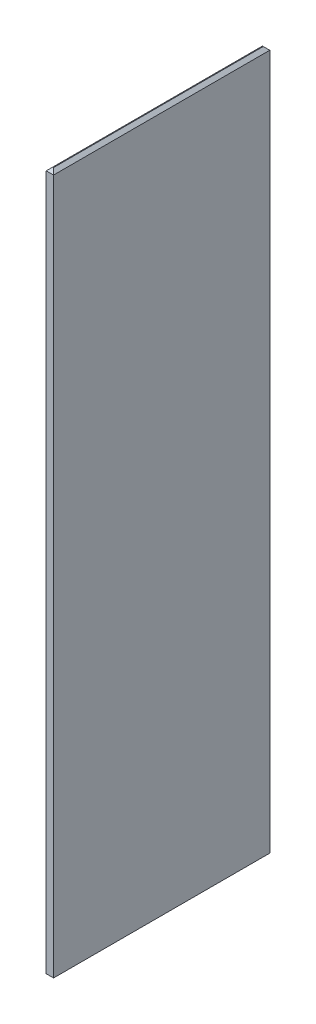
ISO-10303-21;
HEADER;
FILE_DESCRIPTION(('STEP AP214'),'2;1');
FILE_NAME('part.step','',(''),(''),'','','');
FILE_SCHEMA(('AUTOMOTIVE_DESIGN { 1 0 10303 214 1 1 1 1 }'));
ENDSEC;
DATA;
#1=APPLICATION_CONTEXT('core data for automotive mechanical design processes');
#2=APPLICATION_PROTOCOL_DEFINITION('international standard','automotive_design',2000,#1);
#3=PRODUCT_CONTEXT('',#1,'mechanical');
#4=PRODUCT('Part','Part','',(#3));
#5=PRODUCT_RELATED_PRODUCT_CATEGORY('part','',(#4));
#6=PRODUCT_DEFINITION_FORMATION('','',#4);
#7=PRODUCT_DEFINITION_CONTEXT('part definition',#1,'design');
#8=PRODUCT_DEFINITION('design','',#6,#7);
#9=PRODUCT_DEFINITION_SHAPE('','',#8);
#10=(LENGTH_UNIT() NAMED_UNIT(*) SI_UNIT(.MILLI.,.METRE.));
#11=(NAMED_UNIT(*) PLANE_ANGLE_UNIT() SI_UNIT($,.RADIAN.));
#12=(NAMED_UNIT(*) SI_UNIT($,.STERADIAN.) SOLID_ANGLE_UNIT());
#13=UNCERTAINTY_MEASURE_WITH_UNIT(LENGTH_MEASURE(1.E-05),#10,'distance_accuracy_value','');
#14=(GEOMETRIC_REPRESENTATION_CONTEXT(3) GLOBAL_UNCERTAINTY_ASSIGNED_CONTEXT((#13)) GLOBAL_UNIT_ASSIGNED_CONTEXT((#10,
#11,#12)) REPRESENTATION_CONTEXT('',''));
#15=CARTESIAN_POINT('',(0.,0.,0.));
#16=DIRECTION('',(0.,0.,1.));
#17=DIRECTION('',(1.,0.,0.));
#18=AXIS2_PLACEMENT_3D('',#15,#16,#17);
#19=CARTESIAN_POINT('',(-50.7999999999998,9739.6,1500.));
#20=DIRECTION('',(1.,0.,0.));
#21=DIRECTION('',(0.,0.,-1.));
#22=AXIS2_PLACEMENT_3D('',#19,#20,#21);
#23=PLANE('',#22);
#24=DIRECTION('',(0.,-1.,0.));
#25=VECTOR('',#24,1.);
#26=CARTESIAN_POINT('',(-50.8000000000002,9739.6,-1500.));
#27=LINE('',#26,#25);
#28=CARTESIAN_POINT('',(-50.8000000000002,9694.6,-1500.));
#29=VERTEX_POINT('',#28);
#30=CARTESIAN_POINT('',(-50.8000000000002,44.9999999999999,-1500.));
#31=VERTEX_POINT('',#30);
#32=EDGE_CURVE('E154',#29,#31,#27,.T.);
#33=ORIENTED_EDGE('',*,*,#32,.T.);
#34=DIRECTION('',(0.,0.,1.));
#35=VECTOR('',#34,1.);
#36=CARTESIAN_POINT('',(-50.7999999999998,44.9999999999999,1500.));
#37=LINE('',#36,#35);
#38=CARTESIAN_POINT('',(-50.7999999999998,44.9999999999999,1500.));
#39=VERTEX_POINT('',#38);
#40=EDGE_CURVE('E165',#31,#39,#37,.T.);
#41=ORIENTED_EDGE('',*,*,#40,.T.);
#42=DIRECTION('',(0.,-1.,0.));
#43=VECTOR('',#42,1.);
#44=CARTESIAN_POINT('',(-50.7999999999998,9739.6,1500.));
#45=LINE('',#44,#43);
#46=CARTESIAN_POINT('',(-50.7999999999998,9694.6,1500.));
#47=VERTEX_POINT('',#46);
#48=EDGE_CURVE('E133',#47,#39,#45,.T.);
#49=ORIENTED_EDGE('',*,*,#48,.F.);
#50=DIRECTION('',(0.,0.,-1.));
#51=VECTOR('',#50,1.);
#52=CARTESIAN_POINT('',(-50.8000000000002,9694.6,-1500.));
#53=LINE('',#52,#51);
#54=EDGE_CURVE('E168',#47,#29,#53,.T.);
#55=ORIENTED_EDGE('',*,*,#54,.T.);
#56=EDGE_LOOP('',(#33,#41,#49,#55));
#57=FACE_BOUND('',#56,.T.);
#58=ADVANCED_FACE('F44',(#57),#23,.F.);
#59=CARTESIAN_POINT('',(50.8000000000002,9739.6,1500.));
#60=DIRECTION('',(0.,0.,-1.));
#61=DIRECTION('',(-1.,0.,0.));
#62=AXIS2_PLACEMENT_3D('',#59,#60,#61);
#63=PLANE('',#62);
#64=ORIENTED_EDGE('',*,*,#48,.T.);
#65=DIRECTION('',(1.,0.,0.));
#66=VECTOR('',#65,1.);
#67=CARTESIAN_POINT('',(50.8000000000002,44.9999999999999,1500.));
#68=LINE('',#67,#66);
#69=CARTESIAN_POINT('',(50.8000000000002,44.9999999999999,1500.));
#70=VERTEX_POINT('',#69);
#71=EDGE_CURVE('E135',#39,#70,#68,.T.);
#72=ORIENTED_EDGE('',*,*,#71,.T.);
#73=DIRECTION('',(0.,-1.,0.));
#74=VECTOR('',#73,1.);
#75=CARTESIAN_POINT('',(50.8000000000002,9739.6,1500.));
#76=LINE('',#75,#74);
#77=CARTESIAN_POINT('',(50.8000000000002,9694.6,1500.));
#78=VERTEX_POINT('',#77);
#79=EDGE_CURVE('E114',#78,#70,#76,.T.);
#80=ORIENTED_EDGE('',*,*,#79,.F.);
#81=DIRECTION('',(-1.,0.,0.));
#82=VECTOR('',#81,1.);
#83=CARTESIAN_POINT('',(-50.7999999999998,9694.6,1500.));
#84=LINE('',#83,#82);
#85=EDGE_CURVE('E126',#78,#47,#84,.T.);
#86=ORIENTED_EDGE('',*,*,#85,.T.);
#87=EDGE_LOOP('',(#64,#72,#80,#86));
#88=FACE_BOUND('',#87,.T.);
#89=ADVANCED_FACE('F129',(#88),#63,.F.);
#90=CARTESIAN_POINT('',(50.8000000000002,9739.6,1500.));
#91=DIRECTION('',(-1.,0.,0.));
#92=DIRECTION('',(0.,0.,1.));
#93=AXIS2_PLACEMENT_3D('',#90,#91,#92);
#94=PLANE('',#93);
#95=ORIENTED_EDGE('',*,*,#79,.T.);
#96=DIRECTION('',(0.,0.,-1.));
#97=VECTOR('',#96,1.);
#98=CARTESIAN_POINT('',(50.8000000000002,44.9999999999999,1500.));
#99=LINE('',#98,#97);
#100=CARTESIAN_POINT('',(50.7999999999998,44.9999999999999,-1500.));
#101=VERTEX_POINT('',#100);
#102=EDGE_CURVE('E122',#70,#101,#99,.T.);
#103=ORIENTED_EDGE('',*,*,#102,.T.);
#104=DIRECTION('',(0.,-1.,0.));
#105=VECTOR('',#104,1.);
#106=CARTESIAN_POINT('',(50.7999999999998,9739.6,-1500.));
#107=LINE('',#106,#105);
#108=CARTESIAN_POINT('',(50.7999999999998,9694.6,-1500.));
#109=VERTEX_POINT('',#108);
#110=EDGE_CURVE('E120',#109,#101,#107,.T.);
#111=ORIENTED_EDGE('',*,*,#110,.F.);
#112=DIRECTION('',(0.,0.,1.));
#113=VECTOR('',#112,1.);
#114=CARTESIAN_POINT('',(50.8000000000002,9694.6,1500.));
#115=LINE('',#114,#113);
#116=EDGE_CURVE('E115',#109,#78,#115,.T.);
#117=ORIENTED_EDGE('',*,*,#116,.T.);
#118=EDGE_LOOP('',(#95,#103,#111,#117));
#119=FACE_BOUND('',#118,.T.);
#120=ADVANCED_FACE('F112',(#119),#94,.F.);
#121=CARTESIAN_POINT('',(50.7999999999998,9739.6,-1500.));
#122=DIRECTION('',(0.,0.,1.));
#123=DIRECTION('',(1.,0.,0.));
#124=AXIS2_PLACEMENT_3D('',#121,#122,#123);
#125=PLANE('',#124);
#126=ORIENTED_EDGE('',*,*,#110,.T.);
#127=DIRECTION('',(-1.,0.,0.));
#128=VECTOR('',#127,1.);
#129=CARTESIAN_POINT('',(50.7999999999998,44.9999999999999,-1500.));
#130=LINE('',#129,#128);
#131=EDGE_CURVE('E166',#101,#31,#130,.T.);
#132=ORIENTED_EDGE('',*,*,#131,.T.);
#133=ORIENTED_EDGE('',*,*,#32,.F.);
#134=DIRECTION('',(1.,0.,0.));
#135=VECTOR('',#134,1.);
#136=CARTESIAN_POINT('',(50.7999999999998,9694.6,-1500.));
#137=LINE('',#136,#135);
#138=EDGE_CURVE('E167',#29,#109,#137,.T.);
#139=ORIENTED_EDGE('',*,*,#138,.T.);
#140=EDGE_LOOP('',(#126,#132,#133,#139));
#141=FACE_BOUND('',#140,.T.);
#142=ADVANCED_FACE('F206',(#141),#125,.F.);
#143=CARTESIAN_POINT('',(0.,9739.6,0.));
#144=DIRECTION('',(0.,1.,0.));
#145=DIRECTION('',(0.,0.,1.));
#146=AXIS2_PLACEMENT_3D('',#143,#144,#145);
#147=PLANE('',#146);
#148=DIRECTION('',(0.,0.,-1.));
#149=VECTOR('',#148,1.);
#150=CARTESIAN_POINT('',(5.79999999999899,9739.6,-1500.));
#151=LINE('',#150,#149);
#152=CARTESIAN_POINT('',(5.79999999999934,9739.6,1455.));
#153=VERTEX_POINT('',#152);
#154=CARTESIAN_POINT('',(5.79999999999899,9739.6,-1455.));
#155=VERTEX_POINT('',#154);
#156=EDGE_CURVE('E54',#153,#155,#151,.T.);
#157=ORIENTED_EDGE('',*,*,#156,.T.);
#158=DIRECTION('',(-1.,0.,0.));
#159=VECTOR('',#158,1.);
#160=CARTESIAN_POINT('',(-50.8000000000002,9739.6,-1455.));
#161=LINE('',#160,#159);
#162=CARTESIAN_POINT('',(-5.79999999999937,9739.6,-1455.));
#163=VERTEX_POINT('',#162);
#164=EDGE_CURVE('E11',#155,#163,#161,.T.);
#165=ORIENTED_EDGE('',*,*,#164,.T.);
#166=DIRECTION('',(0.,0.,1.));
#167=VECTOR('',#166,1.);
#168=CARTESIAN_POINT('',(-5.79999999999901,9739.6,1500.));
#169=LINE('',#168,#167);
#170=CARTESIAN_POINT('',(-5.79999999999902,9739.6,1455.));
#171=VERTEX_POINT('',#170);
#172=EDGE_CURVE('E162',#163,#171,#169,.T.);
#173=ORIENTED_EDGE('',*,*,#172,.T.);
#174=DIRECTION('',(1.,0.,0.));
#175=VECTOR('',#174,1.);
#176=CARTESIAN_POINT('',(50.8000000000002,9739.6,1455.));
#177=LINE('',#176,#175);
#178=EDGE_CURVE('E66',#171,#153,#177,.T.);
#179=ORIENTED_EDGE('',*,*,#178,.T.);
#180=EDGE_LOOP('',(#157,#165,#173,#179));
#181=FACE_BOUND('',#180,.T.);
#182=ADVANCED_FACE('F211',(#181),#147,.T.);
#183=CARTESIAN_POINT('',(0.,0.,0.));
#184=DIRECTION('',(0.,1.,0.));
#185=DIRECTION('',(0.,0.,1.));
#186=AXIS2_PLACEMENT_3D('',#183,#184,#185);
#187=PLANE('',#186);
#188=DIRECTION('',(0.,0.,1.));
#189=VECTOR('',#188,1.);
#190=CARTESIAN_POINT('',(5.80000000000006,0.,0.));
#191=LINE('',#190,#189);
#192=CARTESIAN_POINT('',(5.79999999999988,0.,-1455.));
#193=VERTEX_POINT('',#192);
#194=CARTESIAN_POINT('',(5.80000000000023,0.,1455.));
#195=VERTEX_POINT('',#194);
#196=EDGE_CURVE('E174',#193,#195,#191,.T.);
#197=ORIENTED_EDGE('',*,*,#196,.T.);
#198=DIRECTION('',(-1.,0.,0.));
#199=VECTOR('',#198,1.);
#200=CARTESIAN_POINT('',(0.,0.,1455.));
#201=LINE('',#200,#199);
#202=CARTESIAN_POINT('',(-5.79999999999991,0.,1455.));
#203=VERTEX_POINT('',#202);
#204=EDGE_CURVE('E125',#195,#203,#201,.T.);
#205=ORIENTED_EDGE('',*,*,#204,.T.);
#206=DIRECTION('',(0.,0.,-1.));
#207=VECTOR('',#206,1.);
#208=CARTESIAN_POINT('',(-5.80000000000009,0.,0.));
#209=LINE('',#208,#207);
#210=CARTESIAN_POINT('',(-5.80000000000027,0.,-1455.));
#211=VERTEX_POINT('',#210);
#212=EDGE_CURVE('E177',#203,#211,#209,.T.);
#213=ORIENTED_EDGE('',*,*,#212,.T.);
#214=DIRECTION('',(1.,0.,0.));
#215=VECTOR('',#214,1.);
#216=CARTESIAN_POINT('',(0.,0.,-1455.));
#217=LINE('',#216,#215);
#218=EDGE_CURVE('E180',#211,#193,#217,.T.);
#219=ORIENTED_EDGE('',*,*,#218,.T.);
#220=EDGE_LOOP('',(#197,#205,#213,#219));
#221=FACE_BOUND('',#220,.T.);
#222=ADVANCED_FACE('F216',(#221),#187,.F.);
#223=CARTESIAN_POINT('',(50.7999999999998,44.9999999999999,-1500.));
#224=DIRECTION('',(0.,0.707106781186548,0.707106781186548));
#225=DIRECTION('',(-1.,0.,0.));
#226=AXIS2_PLACEMENT_3D('',#223,#224,#225);
#227=PLANE('',#226);
#228=DIRECTION('',(-0.577350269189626,-0.577350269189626,0.577350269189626));
#229=VECTOR('',#228,1.);
#230=CARTESIAN_POINT('',(50.7999999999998,44.9999999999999,-1500.));
#231=LINE('',#230,#229);
#232=EDGE_CURVE('E158',#193,#101,#231,.F.);
#233=ORIENTED_EDGE('',*,*,#232,.F.);
#234=ORIENTED_EDGE('',*,*,#218,.F.);
#235=DIRECTION('',(0.577350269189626,-0.577350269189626,0.577350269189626));
#236=VECTOR('',#235,1.);
#237=CARTESIAN_POINT('',(949.2,-955.,-500.));
#238=LINE('',#237,#236);
#239=EDGE_CURVE('E155',#31,#211,#238,.T.);
#240=ORIENTED_EDGE('',*,*,#239,.F.);
#241=ORIENTED_EDGE('',*,*,#131,.F.);
#242=EDGE_LOOP('',(#233,#234,#240,#241));
#243=FACE_BOUND('',#242,.T.);
#244=ADVANCED_FACE('F193',(#243),#227,.F.);
#245=CARTESIAN_POINT('',(-50.7999999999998,44.9999999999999,1500.));
#246=DIRECTION('',(0.707106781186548,0.707106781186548,0.));
#247=DIRECTION('',(0.,0.,1.));
#248=AXIS2_PLACEMENT_3D('',#245,#246,#247);
#249=PLANE('',#248);
#250=ORIENTED_EDGE('',*,*,#239,.T.);
#251=ORIENTED_EDGE('',*,*,#212,.F.);
#252=DIRECTION('',(-0.577350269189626,0.577350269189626,0.577350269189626));
#253=VECTOR('',#252,1.);
#254=CARTESIAN_POINT('',(-50.7999999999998,44.9999999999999,1500.));
#255=LINE('',#254,#253);
#256=EDGE_CURVE('E141',#39,#203,#255,.F.);
#257=ORIENTED_EDGE('',*,*,#256,.F.);
#258=ORIENTED_EDGE('',*,*,#40,.F.);
#259=EDGE_LOOP('',(#250,#251,#257,#258));
#260=FACE_BOUND('',#259,.T.);
#261=ADVANCED_FACE('F197',(#260),#249,.F.);
#262=CARTESIAN_POINT('',(50.8000000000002,44.9999999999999,1500.));
#263=DIRECTION('',(-0.707106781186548,0.707106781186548,0.));
#264=DIRECTION('',(0.,0.,-1.));
#265=AXIS2_PLACEMENT_3D('',#262,#263,#264);
#266=PLANE('',#265);
#267=ORIENTED_EDGE('',*,*,#232,.T.);
#268=ORIENTED_EDGE('',*,*,#102,.F.);
#269=DIRECTION('',(-0.577350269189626,-0.577350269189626,-0.577350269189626));
#270=VECTOR('',#269,1.);
#271=CARTESIAN_POINT('',(50.8000000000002,44.9999999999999,1500.));
#272=LINE('',#271,#270);
#273=EDGE_CURVE('E145',#195,#70,#272,.F.);
#274=ORIENTED_EDGE('',*,*,#273,.F.);
#275=ORIENTED_EDGE('',*,*,#196,.F.);
#276=EDGE_LOOP('',(#267,#268,#274,#275));
#277=FACE_BOUND('',#276,.T.);
#278=ADVANCED_FACE('F210',(#277),#266,.F.);
#279=CARTESIAN_POINT('',(50.8000000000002,44.9999999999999,1500.));
#280=DIRECTION('',(0.,0.707106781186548,-0.707106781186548));
#281=DIRECTION('',(1.,0.,0.));
#282=AXIS2_PLACEMENT_3D('',#279,#280,#281);
#283=PLANE('',#282);
#284=ORIENTED_EDGE('',*,*,#256,.T.);
#285=ORIENTED_EDGE('',*,*,#204,.F.);
#286=ORIENTED_EDGE('',*,*,#273,.T.);
#287=ORIENTED_EDGE('',*,*,#71,.F.);
#288=EDGE_LOOP('',(#284,#285,#286,#287));
#289=FACE_BOUND('',#288,.T.);
#290=ADVANCED_FACE('F204',(#289),#283,.F.);
#291=CARTESIAN_POINT('',(0.,9739.6,1455.));
#292=DIRECTION('',(0.,0.707106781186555,0.707106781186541));
#293=DIRECTION('',(-1.,0.,0.));
#294=AXIS2_PLACEMENT_3D('',#291,#292,#293);
#295=PLANE('',#294);
#296=DIRECTION('',(0.57735026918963,0.577350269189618,-0.57735026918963));
#297=VECTOR('',#296,1.);
#298=CARTESIAN_POINT('',(479.200000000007,10224.6,969.999999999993));
#299=LINE('',#298,#297);
#300=EDGE_CURVE('E137',#47,#171,#299,.T.);
#301=ORIENTED_EDGE('',*,*,#300,.F.);
#302=ORIENTED_EDGE('',*,*,#85,.F.);
#303=DIRECTION('',(-0.57735026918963,0.577350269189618,-0.57735026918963));
#304=VECTOR('',#303,1.);
#305=CARTESIAN_POINT('',(3.8666666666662,9741.53333333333,1453.06666666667));
#306=LINE('',#305,#304);
#307=EDGE_CURVE('E49',#153,#78,#306,.F.);
#308=ORIENTED_EDGE('',*,*,#307,.F.);
#309=ORIENTED_EDGE('',*,*,#178,.F.);
#310=EDGE_LOOP('',(#301,#302,#308,#309));
#311=FACE_BOUND('',#310,.T.);
#312=ADVANCED_FACE('F48',(#311),#295,.T.);
#313=CARTESIAN_POINT('',(5.79999999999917,9739.6,0.));
#314=DIRECTION('',(0.707106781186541,0.707106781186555,0.));
#315=DIRECTION('',(0.,0.,1.));
#316=AXIS2_PLACEMENT_3D('',#313,#314,#315);
#317=PLANE('',#316);
#318=ORIENTED_EDGE('',*,*,#307,.T.);
#319=ORIENTED_EDGE('',*,*,#116,.F.);
#320=DIRECTION('',(-0.57735026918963,0.577350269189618,0.57735026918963));
#321=VECTOR('',#320,1.);
#322=CARTESIAN_POINT('',(-479.200000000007,10224.6,-969.999999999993));
#323=LINE('',#322,#321);
#324=EDGE_CURVE('E143',#155,#109,#323,.F.);
#325=ORIENTED_EDGE('',*,*,#324,.F.);
#326=ORIENTED_EDGE('',*,*,#156,.F.);
#327=EDGE_LOOP('',(#318,#319,#325,#326));
#328=FACE_BOUND('',#327,.T.);
#329=ADVANCED_FACE('F142',(#328),#317,.T.);
#330=CARTESIAN_POINT('',(-5.79999999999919,9739.6,0.));
#331=DIRECTION('',(-0.707106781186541,0.707106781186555,0.));
#332=DIRECTION('',(0.,0.,-1.));
#333=AXIS2_PLACEMENT_3D('',#330,#331,#332);
#334=PLANE('',#333);
#335=ORIENTED_EDGE('',*,*,#300,.T.);
#336=ORIENTED_EDGE('',*,*,#172,.F.);
#337=DIRECTION('',(-0.57735026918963,-0.577350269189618,-0.57735026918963));
#338=VECTOR('',#337,1.);
#339=CARTESIAN_POINT('',(479.200000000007,10224.6,-969.999999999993));
#340=LINE('',#339,#338);
#341=EDGE_CURVE('E149',#29,#163,#340,.F.);
#342=ORIENTED_EDGE('',*,*,#341,.F.);
#343=ORIENTED_EDGE('',*,*,#54,.F.);
#344=EDGE_LOOP('',(#335,#336,#342,#343));
#345=FACE_BOUND('',#344,.T.);
#346=ADVANCED_FACE('F214',(#345),#334,.T.);
#347=CARTESIAN_POINT('',(0.,9739.6,-1455.));
#348=DIRECTION('',(0.,0.707106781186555,-0.707106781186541));
#349=DIRECTION('',(1.,0.,0.));
#350=AXIS2_PLACEMENT_3D('',#347,#348,#349);
#351=PLANE('',#350);
#352=ORIENTED_EDGE('',*,*,#324,.T.);
#353=ORIENTED_EDGE('',*,*,#138,.F.);
#354=ORIENTED_EDGE('',*,*,#341,.T.);
#355=ORIENTED_EDGE('',*,*,#164,.F.);
#356=EDGE_LOOP('',(#352,#353,#354,#355));
#357=FACE_BOUND('',#356,.T.);
#358=ADVANCED_FACE('F212',(#357),#351,.T.);
#359=CLOSED_SHELL('',(#58,#89,#120,#142,#182,#222,#244,#261,#278,#290,#312,#329,#346,#358));
#360=MANIFOLD_SOLID_BREP('B2',#359);
#361=ADVANCED_BREP_SHAPE_REPRESENTATION('',(#18,#360),#14);
#362=SHAPE_DEFINITION_REPRESENTATION(#9,#361);
ENDSEC;
END-ISO-10303-21;
